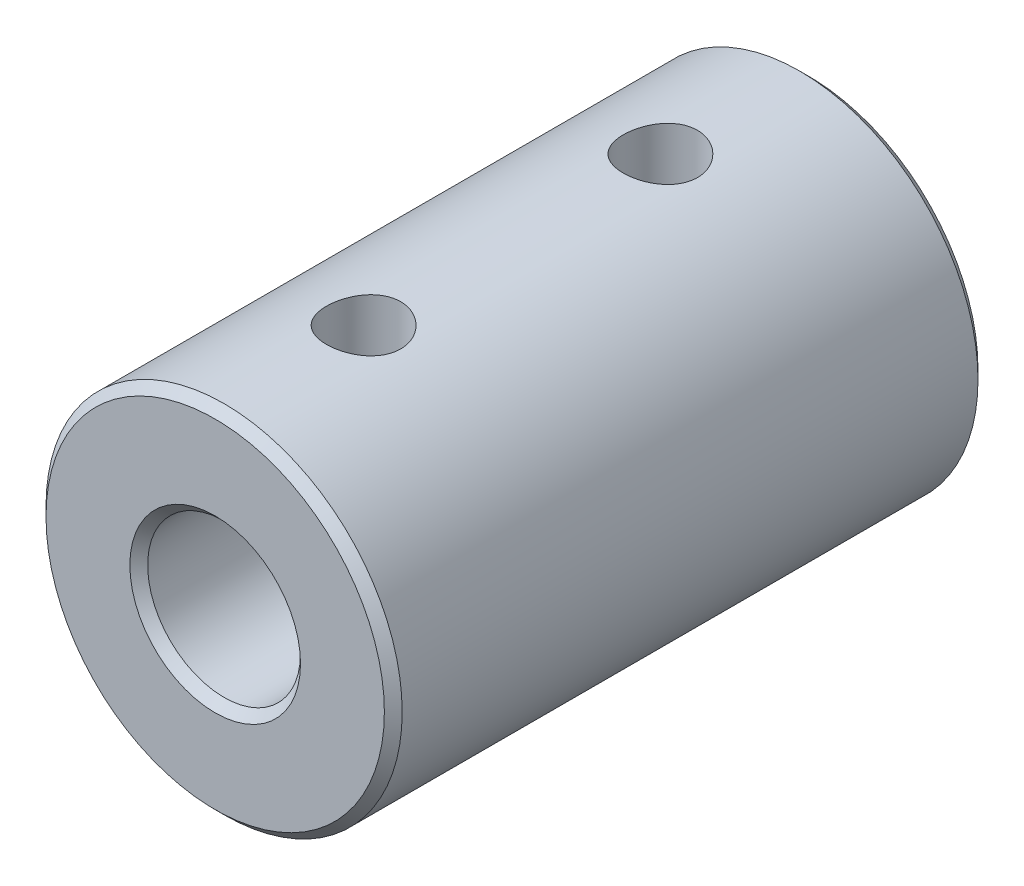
from build123d import *

# Parameters (mm, degrees)
ESQUISSE1_R             = 6
ESQUISSE1_R_2           = 2.575
BOSS_EXTRU_1_DEPTH      = 10
ESQUISSE3_R             = 1.25
ENL_V_MAT_EXTRU_2_DEPTH = 6
CHANFREIN1_SIZE         = 0.3


with BuildPart() as part:
    # Esquisse1 → Boss.-Extru.1 (new, symmetric)
    with BuildSketch(Plane.XY):
        Circle(ESQUISSE1_R)
        Circle(ESQUISSE1_R_2, mode=Mode.SUBTRACT)
    extrude(amount=BOSS_EXTRU_1_DEPTH, both=True)

    # Esquisse3 → Enl_v. mat.-Extru.2 (cut, symmetric)
    with BuildSketch(Plane(origin=(0, 0, 0), x_dir=(-1, 0, 0), z_dir=(0, 1, 0))):
        with Locations(Location((0, 5, 0), (0, 0, 90))):
            Circle(ESQUISSE3_R)
        with Locations(Location((0, -5, 0), (0, 0, 90))):
            Circle(ESQUISSE3_R)
    extrude(amount=ENL_V_MAT_EXTRU_2_DEPTH, both=True, mode=Mode.SUBTRACT)

    # Chanfrein1
    chanfrein1_edges = [part.edges().sort_by_distance(p)[0] for p in [
        (-6, 0, -10),
        (-6, 0, 10),
        (-2.575, 0, -10),
        (-2.575, 0, 10),
    ]]
    chamfer(chanfrein1_edges, length=CHANFREIN1_SIZE)


solid = part.part
